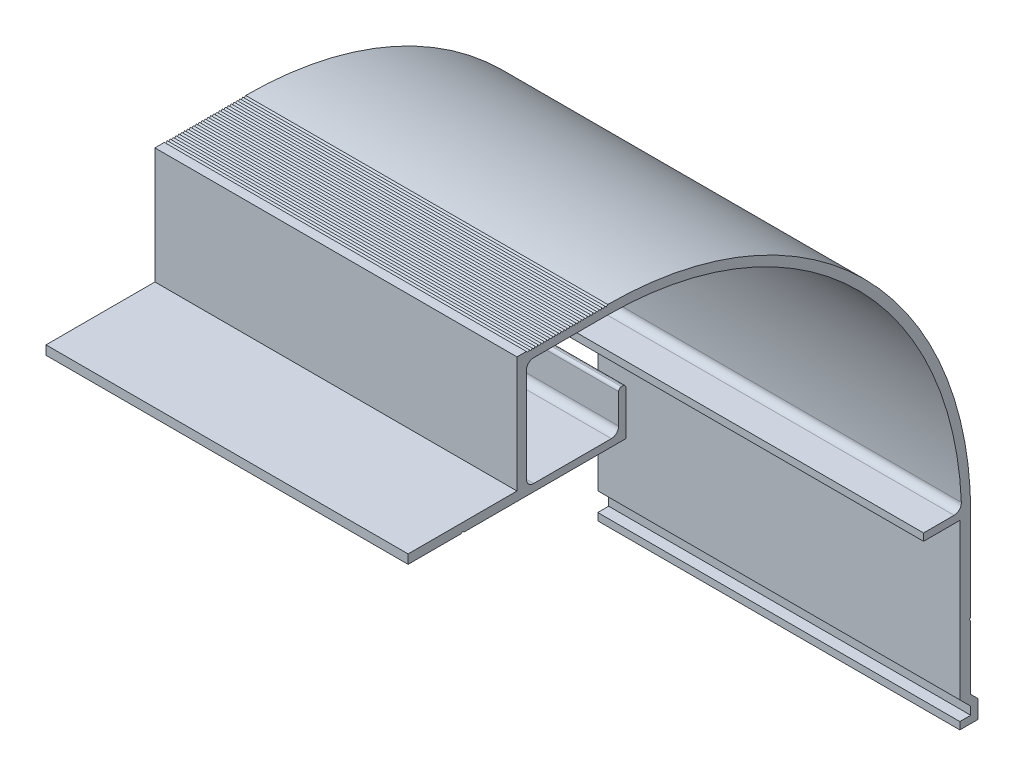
from build123d import *

# Parameters (mm, degrees)
EXTRUDE1_DEPTH = 50


with BuildPart() as part:
    # Sketch1 → Extrude1 (new, symmetric)
    with BuildSketch(Plane(origin=(0, 0, 0), x_dir=(0, 0, -1), z_dir=(1, 0, 0))):
        with BuildLine():
            Line((55.13959, 32.081216), (34.6878148, 32.081216))
            ThreePointArc((34.6878148, 32.081216), (33.270011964, 31.493942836), (32.6827388, 30.07614))
            Line((32.6827388, 30.07614), (32.6827388, 4.010152))
            ThreePointArc((32.6827388, 4.010152), (33.270011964, 2.592349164), (34.6878148, 2.005076))
            Line((34.6878148, 2.005076), (56.142128, 2.005076))
            ThreePointArc((56.142128, 2.005076), (57.559930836, 2.592349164), (58.147204, 4.010152))
            Line((58.147204, 4.010152), (58.147204, 12.2309636))
            ThreePointArc((58.147204, 12.2309636), (58.382113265, 12.798084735), (58.9492344, 13.032994))
            Line((58.9492344, 13.032994), (59.3502496, 13.032994))
            ThreePointArc((59.3502496, 13.032994), (59.917370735, 12.798084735), (60.15228, 12.2309636))
            Line((60.15228, 12.2309636), (60.15228, 0))
            Line((60.15228, 0), (15.4390852, 0))
            Line((15.4390852, 0), (15.03807, 0.4010152))
            Line((15.03807, 0.4010152), (14.6370548, 0))
            Line((14.6370548, 0), (0, 0))
            Line((0, 0), (0, 2.506345))
            Line((0, 2.506345), (30.07614, 2.506345))
            Line((30.07614, 2.506345), (30.07614, 34.587561))
            Line((30.07614, 34.587561), (32.6827388, 34.587561))
            Line((32.6827388, 34.587561), (33.083754, 34.1865458))
            Line((33.083754, 34.1865458), (33.4847692, 34.587561))
            Line((33.4847692, 34.587561), (33.8857844, 34.1865458))
            Line((33.8857844, 34.1865458), (34.2867996, 34.587561))
            Line((34.2867996, 34.587561), (34.6878148, 34.1865458))
            Line((34.6878148, 34.1865458), (35.08883, 34.587561))
            Line((35.08883, 34.587561), (35.4898452, 34.1865458))
            Line((35.4898452, 34.1865458), (35.8908604, 34.587561))
            Line((35.8908604, 34.587561), (36.2918756, 34.1865458))
            Line((36.2918756, 34.1865458), (36.6928908, 34.587561))
            Line((36.6928908, 34.587561), (37.093906, 34.1865458))
            Line((37.093906, 34.1865458), (37.4949212, 34.587561))
            Line((37.4949212, 34.587561), (37.8959364, 34.1865458))
            Line((37.8959364, 34.1865458), (38.2969516, 34.587561))
            Line((38.2969516, 34.587561), (38.6979668, 34.1865458))
            Line((38.6979668, 34.1865458), (39.098982, 34.587561))
            Line((39.098982, 34.587561), (39.4999972, 34.1865458))
            Line((39.4999972, 34.1865458), (39.9010124, 34.587561))
            Line((39.9010124, 34.587561), (40.3020276, 34.1865458))
            Line((40.3020276, 34.1865458), (40.7030428, 34.587561))
            Line((40.7030428, 34.587561), (41.104058, 34.1865458))
            Line((41.104058, 34.1865458), (41.5050732, 34.587561))
            Line((41.5050732, 34.587561), (41.9060884, 34.1865458))
            Line((41.9060884, 34.1865458), (42.3071036, 34.587561))
            Line((42.3071036, 34.587561), (42.7081188, 34.1865458))
            Line((42.7081188, 34.1865458), (43.109134, 34.587561))
            Line((43.109134, 34.587561), (43.5101492, 34.1865458))
            Line((43.5101492, 34.1865458), (43.9111644, 34.587561))
            Line((43.9111644, 34.587561), (44.3121796, 34.1865458))
            Line((44.3121796, 34.1865458), (44.7131948, 34.587561))
            Line((44.7131948, 34.587561), (45.11421, 34.1865458))
            Line((45.11421, 34.1865458), (45.5152252, 34.587561))
            Line((45.5152252, 34.587561), (45.9162404, 34.1865458))
            Line((45.9162404, 34.1865458), (46.3172556, 34.587561))
            Line((46.3172556, 34.587561), (46.7182708, 34.1865458))
            Line((46.7182708, 34.1865458), (47.119286, 34.587561))
            Line((47.119286, 34.587561), (47.5203012, 34.1865458))
            Line((47.5203012, 34.1865458), (47.9213164, 34.587561))
            Line((47.9213164, 34.587561), (48.3223316, 34.1865458))
            Line((48.3223316, 34.1865458), (48.7233468, 34.587561))
            Line((48.7233468, 34.587561), (49.124362, 34.1865458))
            Line((49.124362, 34.1865458), (49.5253772, 34.587561))
            Line((49.5253772, 34.587561), (49.9263924, 34.1865458))
            Line((49.9263924, 34.1865458), (50.3274076, 34.587561))
            Line((50.3274076, 34.587561), (50.7284228, 34.1865458))
            Line((50.7284228, 34.1865458), (51.129438, 34.587561))
            Line((51.129438, 34.587561), (51.5304532, 34.1865458))
            Line((51.5304532, 34.1865458), (51.9314684, 34.587561))
            Line((51.9314684, 34.587561), (52.3324836, 34.1865458))
            Line((52.3324836, 34.1865458), (52.7334988, 34.587561))
            Line((52.7334988, 34.587561), (53.134514, 34.1865458))
            Line((53.134514, 34.1865458), (53.5355292, 34.587561))
            Line((53.5355292, 34.587561), (53.9365444, 34.1865458))
            Line((53.9365444, 34.1865458), (54.3375596, 34.587561))
            Line((54.3375596, 34.587561), (54.7385748, 34.1865458))
            Line((54.7385748, 34.1865458), (55.13959, 34.587561))
            ThreePointArc((55.13959, 34.587561), (126.02973182, 5.22390282), (155.39339, -65.666239))
            Line((155.39339, -65.666239), (155.39339, -90.3286738))
            Line((155.39339, -90.3286738), (154.9923748, -90.729689))
            Line((154.9923748, -90.729689), (155.39339, -91.1307042))
            Line((155.39339, -91.1307042), (155.39339, -108.775373))
            Line((155.39339, -108.775373), (157.398466, -110.780449))
            Line((157.398466, -110.780449), (157.398466, -115.793139))
            Line((157.398466, -115.793139), (152.385776, -115.793139))
            Line((152.385776, -115.793139), (152.385776, -113.788063))
            Line((152.385776, -113.788063), (155.39339, -113.788063))
            Line((155.39339, -113.788063), (155.39339, -111.610978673))
            Line((155.39339, -111.610978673), (152.385776, -108.603364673))
            Line((152.385776, -108.603364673), (152.385776, -65.666239))
            Line((152.385776, -65.666239), (142.360396, -65.666239))
            Line((142.360396, -65.666239), (142.360396, -63.661163))
            Line((142.360396, -63.661163), (150.797949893, -63.661163))
            ThreePointArc((150.797949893, -63.661163), (152.245140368, -63.04388003), (152.801266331, -61.572104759))
            ThreePointArc((152.801266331, -61.572104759), (122.79450023, 4.884296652), (55.13959, 32.081216))
        make_face()
    extrude(amount=EXTRUDE1_DEPTH, both=True)


solid = part.part
